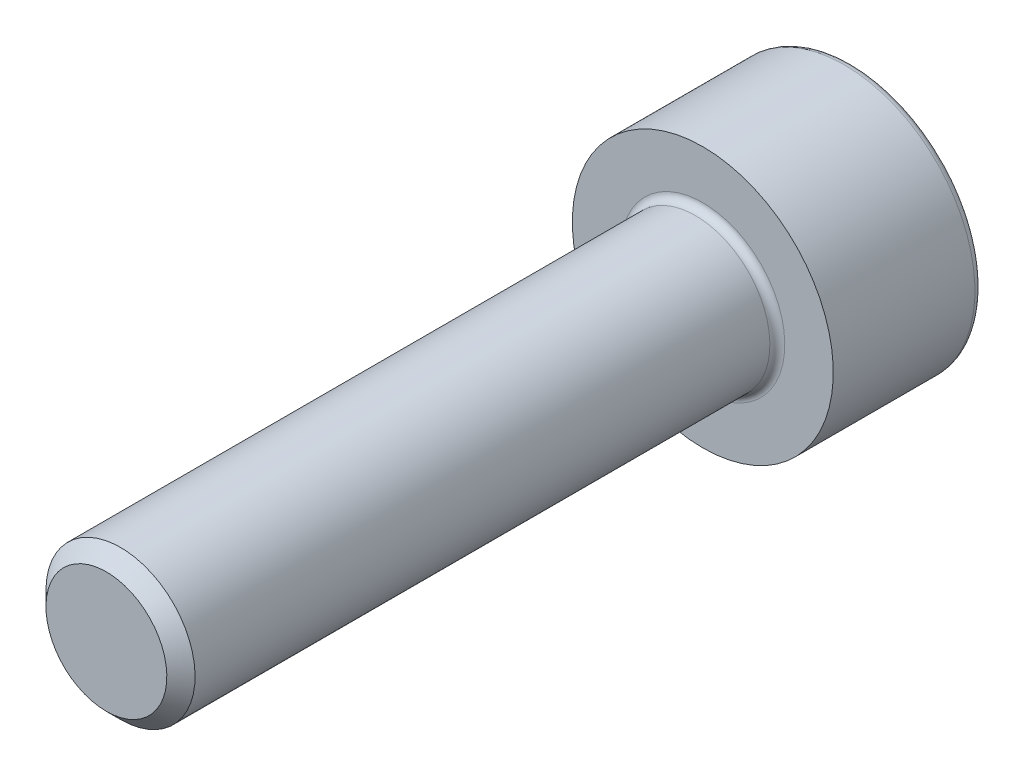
from build123d import *

# Parameters (mm, degrees)
CHAMFER1_SIZE      = 0.378875
FILLET1_R          = 0.2
HOLE1_D            = 3
HOLE1_DEPTH        = 2
HOLE1_TIP          = 0.866025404
CUT_EXTRUDE1_DEPTH = 2


with BuildPart() as part:
    # Sketch1 → Base-Revolve (revolve)
    with BuildSketch(Plane(origin=(0, 0, 0), x_dir=(0, 0, -1), z_dir=(1, 0, 0)), mode=Mode.PRIVATE) as base_revolve_sk:
        Polygon((4, 0), (4, 3.5), (0, 3.5), (0, 2), (-16, 2), (-16, 0), align=None)
    revolve(base_revolve_sk.sketch.rotate(Axis((0, 0, -4), (0, 0, 1)), 180), axis=Axis((0, 0, -4), (0, 0, 1)))

    # Chamfer1
    chamfer1_edges = [part.edges().sort_by_distance(p)[0] for p in [
        (0, 2, 16),
    ]]
    chamfer(chamfer1_edges, length=CHAMFER1_SIZE)

    # Fillet1
    fillet1_edges = [part.edges().sort_by_distance(p)[0] for p in [
        (0, 2, 0),
        (0, 3.5, -4),
    ]]
    fillet(fillet1_edges, radius=FILLET1_R)

    # Hole1
    with Locations(Plane(origin=(0, 0, -4), x_dir=(-1, 0, 0), z_dir=(0, 0, -1))):
        with Locations((0, 0)):
            Hole(HOLE1_D / 2, depth=HOLE1_DEPTH)
            with Locations((0, 0, -(HOLE1_DEPTH + HOLE1_TIP / 2))):  # 120° drill point
                Cone(0, HOLE1_D / 2, HOLE1_TIP, mode=Mode.SUBTRACT)

    # Sketch4 → Cut-Extrude1 (cut)
    with BuildSketch(Plane(origin=(0, 0, -4), x_dir=(-1, 0, 0), z_dir=(0, 0, -1))):
        Polygon((0.866025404, 1.5), (-0.866025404, 1.5), (-1.732050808, 0), (-0.866025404, -1.5), (0.866025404, -1.5), (1.732050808, 0), align=None)
    extrude(amount=-CUT_EXTRUDE1_DEPTH, mode=Mode.SUBTRACT)


solid = part.part
